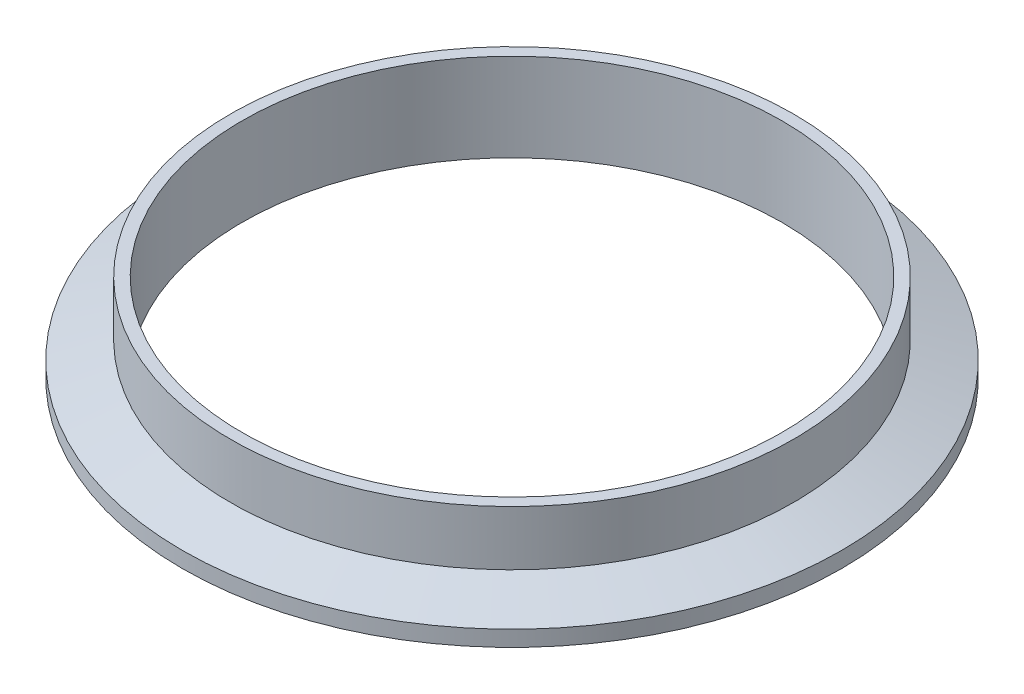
ISO-10303-21;
HEADER;
FILE_DESCRIPTION(('STEP AP214'),'2;1');
FILE_NAME('part.step','',(''),(''),'','','');
FILE_SCHEMA(('AUTOMOTIVE_DESIGN { 1 0 10303 214 1 1 1 1 }'));
ENDSEC;
DATA;
#1=APPLICATION_CONTEXT('core data for automotive mechanical design processes');
#2=APPLICATION_PROTOCOL_DEFINITION('international standard','automotive_design',2000,#1);
#3=PRODUCT_CONTEXT('',#1,'mechanical');
#4=PRODUCT('Part','Part','',(#3));
#5=PRODUCT_RELATED_PRODUCT_CATEGORY('part','',(#4));
#6=PRODUCT_DEFINITION_FORMATION('','',#4);
#7=PRODUCT_DEFINITION_CONTEXT('part definition',#1,'design');
#8=PRODUCT_DEFINITION('design','',#6,#7);
#9=PRODUCT_DEFINITION_SHAPE('','',#8);
#10=(LENGTH_UNIT() NAMED_UNIT(*) SI_UNIT(.MILLI.,.METRE.));
#11=(NAMED_UNIT(*) PLANE_ANGLE_UNIT() SI_UNIT($,.RADIAN.));
#12=(NAMED_UNIT(*) SI_UNIT($,.STERADIAN.) SOLID_ANGLE_UNIT());
#13=UNCERTAINTY_MEASURE_WITH_UNIT(LENGTH_MEASURE(1.E-05),#10,'distance_accuracy_value','');
#14=(GEOMETRIC_REPRESENTATION_CONTEXT(3) GLOBAL_UNCERTAINTY_ASSIGNED_CONTEXT((#13)) GLOBAL_UNIT_ASSIGNED_CONTEXT((#10,
#11,#12)) REPRESENTATION_CONTEXT('',''));
#15=CARTESIAN_POINT('',(0.,0.,0.));
#16=DIRECTION('',(0.,0.,1.));
#17=DIRECTION('',(1.,0.,0.));
#18=AXIS2_PLACEMENT_3D('',#15,#16,#17);
#19=CARTESIAN_POINT('',(0.,0.787400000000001,0.));
#20=DIRECTION('',(0.,-1.,0.));
#21=DIRECTION('',(0.,0.,-1.));
#22=AXIS2_PLACEMENT_3D('',#19,#20,#21);
#23=TOROIDAL_SURFACE('',#22,56.6185084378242,0.787400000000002);
#24=CARTESIAN_POINT('',(0.,0.,0.));
#25=DIRECTION('',(0.,-1.,0.));
#26=DIRECTION('',(0.,0.,-1.));
#27=AXIS2_PLACEMENT_3D('',#24,#25,#26);
#28=CIRCLE('',#27,56.6185084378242);
#29=CARTESIAN_POINT('',(0.,0.,-56.6185084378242));
#30=VERTEX_POINT('',#29);
#31=EDGE_CURVE('E75',#30,#30,#28,.T.);
#32=ORIENTED_EDGE('',*,*,#31,.T.);
#33=EDGE_LOOP('',(#32));
#34=FACE_BOUND('',#33,.T.);
#35=CARTESIAN_POINT('',(0.,0.474458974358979,0.));
#36=DIRECTION('',(0.,-1.,0.));
#37=DIRECTION('',(0.,0.,-1.));
#38=AXIS2_PLACEMENT_3D('',#35,#36,#37);
#39=CIRCLE('',#38,55.8959666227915);
#40=CARTESIAN_POINT('',(0.,0.474458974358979,-55.8959666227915));
#41=VERTEX_POINT('',#40);
#42=EDGE_CURVE('E12',#41,#41,#39,.T.);
#43=ORIENTED_EDGE('',*,*,#42,.F.);
#44=EDGE_LOOP('',(#43));
#45=FACE_BOUND('',#44,.T.);
#46=ADVANCED_FACE('F41',(#34,#45),#23,.T.);
#47=CARTESIAN_POINT('',(0.,0.,0.));
#48=DIRECTION('',(0.,-1.,0.));
#49=DIRECTION('',(0.,0.,-1.));
#50=AXIS2_PLACEMENT_3D('',#47,#48,#49);
#51=TOROIDAL_SURFACE('',#50,54.8005,1.1938);
#52=CARTESIAN_POINT('',(0.,0.474458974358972,0.));
#53=DIRECTION('',(0.,-1.,0.));
#54=DIRECTION('',(0.,0.,-1.));
#55=AXIS2_PLACEMENT_3D('',#52,#53,#54);
#56=CIRCLE('',#55,53.7050333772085);
#57=CARTESIAN_POINT('',(0.,0.474458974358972,-53.7050333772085));
#58=VERTEX_POINT('',#57);
#59=EDGE_CURVE('E47',#58,#58,#56,.T.);
#60=ORIENTED_EDGE('',*,*,#59,.F.);
#61=EDGE_LOOP('',(#60));
#62=FACE_BOUND('',#61,.T.);
#63=ORIENTED_EDGE('',*,*,#42,.T.);
#64=EDGE_LOOP('',(#63));
#65=FACE_BOUND('',#64,.T.);
#66=ADVANCED_FACE('F123',(#62,#65),#51,.F.);
#67=CARTESIAN_POINT('',(0.,0.787400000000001,0.));
#68=DIRECTION('',(0.,-1.,0.));
#69=DIRECTION('',(0.,0.,-1.));
#70=AXIS2_PLACEMENT_3D('',#67,#68,#69);
#71=TOROIDAL_SURFACE('',#70,52.9824915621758,0.787399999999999);
#72=ORIENTED_EDGE('',*,*,#59,.T.);
#73=EDGE_LOOP('',(#72));
#74=FACE_BOUND('',#73,.T.);
#75=CARTESIAN_POINT('',(0.,0.,0.));
#76=DIRECTION('',(0.,-1.,0.));
#77=DIRECTION('',(0.,0.,-1.));
#78=AXIS2_PLACEMENT_3D('',#75,#76,#77);
#79=CIRCLE('',#78,52.9824915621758);
#80=CARTESIAN_POINT('',(0.,0.,-52.9824915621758));
#81=VERTEX_POINT('',#80);
#82=EDGE_CURVE('E51',#81,#81,#79,.T.);
#83=ORIENTED_EDGE('',*,*,#82,.F.);
#84=EDGE_LOOP('',(#83));
#85=FACE_BOUND('',#84,.T.);
#86=ADVANCED_FACE('F119',(#74,#85),#71,.T.);
#87=CARTESIAN_POINT('',(0.,0.,0.));
#88=DIRECTION('',(0.,1.,0.));
#89=DIRECTION('',(0.,0.,1.));
#90=AXIS2_PLACEMENT_3D('',#87,#88,#89);
#91=PLANE('',#90);
#92=CARTESIAN_POINT('',(0.,0.,0.));
#93=DIRECTION('',(0.,-1.,0.));
#94=DIRECTION('',(0.,0.,-1.));
#95=AXIS2_PLACEMENT_3D('',#92,#93,#94);
#96=CIRCLE('',#95,48.6918);
#97=CARTESIAN_POINT('',(0.,0.,-48.6918));
#98=VERTEX_POINT('',#97);
#99=EDGE_CURVE('E55',#98,#98,#96,.T.);
#100=ORIENTED_EDGE('',*,*,#99,.F.);
#101=EDGE_LOOP('',(#100));
#102=FACE_BOUND('',#101,.T.);
#103=ORIENTED_EDGE('',*,*,#82,.T.);
#104=EDGE_LOOP('',(#103));
#105=FACE_BOUND('',#104,.T.);
#106=ADVANCED_FACE('F113',(#102,#105),#91,.F.);
#107=CARTESIAN_POINT('',(0.,0.,0.));
#108=DIRECTION('',(0.,-1.,0.));
#109=DIRECTION('',(0.,0.,-1.));
#110=AXIS2_PLACEMENT_3D('',#107,#108,#109);
#111=CYLINDRICAL_SURFACE('',#110,48.6918);
#112=ORIENTED_EDGE('',*,*,#99,.T.);
#113=EDGE_LOOP('',(#112));
#114=FACE_BOUND('',#113,.T.);
#115=CARTESIAN_POINT('',(0.,15.875,0.));
#116=DIRECTION('',(0.,-1.,0.));
#117=DIRECTION('',(0.,0.,-1.));
#118=AXIS2_PLACEMENT_3D('',#115,#116,#117);
#119=CIRCLE('',#118,48.6918);
#120=CARTESIAN_POINT('',(0.,15.875,-48.6918));
#121=VERTEX_POINT('',#120);
#122=EDGE_CURVE('E60',#121,#121,#119,.T.);
#123=ORIENTED_EDGE('',*,*,#122,.F.);
#124=EDGE_LOOP('',(#123));
#125=FACE_BOUND('',#124,.T.);
#126=ADVANCED_FACE('F108',(#114,#125),#111,.F.);
#127=CARTESIAN_POINT('',(0.,15.875,0.));
#128=DIRECTION('',(0.,-1.,0.));
#129=DIRECTION('',(0.,0.,-1.));
#130=AXIS2_PLACEMENT_3D('',#127,#128,#129);
#131=PLANE('',#130);
#132=CARTESIAN_POINT('',(0.,15.875,0.));
#133=DIRECTION('',(0.,-1.,0.));
#134=DIRECTION('',(0.,0.,-1.));
#135=AXIS2_PLACEMENT_3D('',#132,#133,#134);
#136=CIRCLE('',#135,50.8);
#137=CARTESIAN_POINT('',(0.,15.875,-50.8));
#138=VERTEX_POINT('',#137);
#139=EDGE_CURVE('E63',#138,#138,#136,.T.);
#140=ORIENTED_EDGE('',*,*,#139,.F.);
#141=EDGE_LOOP('',(#140));
#142=FACE_BOUND('',#141,.T.);
#143=ORIENTED_EDGE('',*,*,#122,.T.);
#144=EDGE_LOOP('',(#143));
#145=FACE_BOUND('',#144,.T.);
#146=ADVANCED_FACE('F102',(#142,#145),#131,.F.);
#147=CARTESIAN_POINT('',(0.,0.,0.));
#148=DIRECTION('',(0.,-1.,0.));
#149=DIRECTION('',(0.,0.,-1.));
#150=AXIS2_PLACEMENT_3D('',#147,#148,#149);
#151=CYLINDRICAL_SURFACE('',#150,50.8);
#152=CARTESIAN_POINT('',(0.,5.99729178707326,0.));
#153=DIRECTION('',(0.,-1.,0.));
#154=DIRECTION('',(0.,0.,-1.));
#155=AXIS2_PLACEMENT_3D('',#152,#153,#154);
#156=CIRCLE('',#155,50.8);
#157=CARTESIAN_POINT('',(0.,5.99729178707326,-50.8));
#158=VERTEX_POINT('',#157);
#159=EDGE_CURVE('E66',#158,#158,#156,.T.);
#160=ORIENTED_EDGE('',*,*,#159,.F.);
#161=EDGE_LOOP('',(#160));
#162=FACE_BOUND('',#161,.T.);
#163=ORIENTED_EDGE('',*,*,#139,.T.);
#164=EDGE_LOOP('',(#163));
#165=FACE_BOUND('',#164,.T.);
#166=ADVANCED_FACE('F96',(#162,#165),#151,.T.);
#167=CARTESIAN_POINT('',(0.,5.99729178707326,0.));
#168=DIRECTION('',(0.,-1.,0.));
#169=DIRECTION('',(0.,0.,-1.));
#170=AXIS2_PLACEMENT_3D('',#167,#168,#169);
#171=CONICAL_SURFACE('',#170,50.8,1.22173047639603);
#172=CARTESIAN_POINT('',(0.,2.8448,0.));
#173=DIRECTION('',(0.,-1.,0.));
#174=DIRECTION('',(0.,0.,-1.));
#175=AXIS2_PLACEMENT_3D('',#172,#173,#174);
#176=CIRCLE('',#175,59.4614);
#177=CARTESIAN_POINT('',(0.,2.8448,-59.4614));
#178=VERTEX_POINT('',#177);
#179=EDGE_CURVE('E69',#178,#178,#176,.T.);
#180=ORIENTED_EDGE('',*,*,#179,.F.);
#181=EDGE_LOOP('',(#180));
#182=FACE_BOUND('',#181,.T.);
#183=ORIENTED_EDGE('',*,*,#159,.T.);
#184=EDGE_LOOP('',(#183));
#185=FACE_BOUND('',#184,.T.);
#186=ADVANCED_FACE('F90',(#182,#185),#171,.T.);
#187=CARTESIAN_POINT('',(0.,0.,0.));
#188=DIRECTION('',(0.,-1.,0.));
#189=DIRECTION('',(0.,0.,-1.));
#190=AXIS2_PLACEMENT_3D('',#187,#188,#189);
#191=CYLINDRICAL_SURFACE('',#190,59.4614);
#192=CARTESIAN_POINT('',(0.,0.,0.));
#193=DIRECTION('',(0.,-1.,0.));
#194=DIRECTION('',(0.,0.,-1.));
#195=AXIS2_PLACEMENT_3D('',#192,#193,#194);
#196=CIRCLE('',#195,59.4614);
#197=CARTESIAN_POINT('',(0.,0.,-59.4614));
#198=VERTEX_POINT('',#197);
#199=EDGE_CURVE('E72',#198,#198,#196,.T.);
#200=ORIENTED_EDGE('',*,*,#199,.F.);
#201=EDGE_LOOP('',(#200));
#202=FACE_BOUND('',#201,.T.);
#203=ORIENTED_EDGE('',*,*,#179,.T.);
#204=EDGE_LOOP('',(#203));
#205=FACE_BOUND('',#204,.T.);
#206=ADVANCED_FACE('F84',(#202,#205),#191,.T.);
#207=CARTESIAN_POINT('',(0.,0.,0.));
#208=DIRECTION('',(0.,1.,0.));
#209=DIRECTION('',(0.,0.,1.));
#210=AXIS2_PLACEMENT_3D('',#207,#208,#209);
#211=PLANE('',#210);
#212=ORIENTED_EDGE('',*,*,#31,.F.);
#213=EDGE_LOOP('',(#212));
#214=FACE_BOUND('',#213,.T.);
#215=ORIENTED_EDGE('',*,*,#199,.T.);
#216=EDGE_LOOP('',(#215));
#217=FACE_BOUND('',#216,.T.);
#218=ADVANCED_FACE('F81',(#214,#217),#211,.F.);
#219=CLOSED_SHELL('',(#46,#66,#86,#106,#126,#146,#166,#186,#206,#218));
#220=MANIFOLD_SOLID_BREP('B2',#219);
#221=ADVANCED_BREP_SHAPE_REPRESENTATION('',(#18,#220),#14);
#222=SHAPE_DEFINITION_REPRESENTATION(#9,#221);
ENDSEC;
END-ISO-10303-21;
